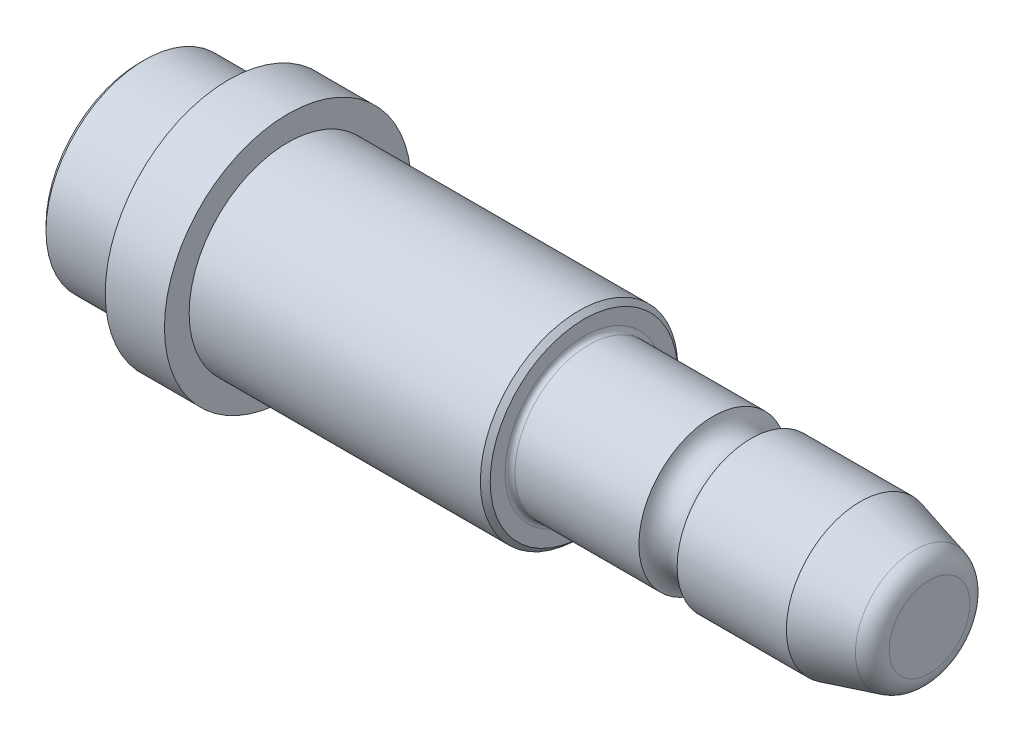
ISO-10303-21;
HEADER;
FILE_DESCRIPTION(('STEP AP214'),'2;1');
FILE_NAME('part.step','',(''),(''),'','','');
FILE_SCHEMA(('AUTOMOTIVE_DESIGN { 1 0 10303 214 1 1 1 1 }'));
ENDSEC;
DATA;
#1=APPLICATION_CONTEXT('core data for automotive mechanical design processes');
#2=APPLICATION_PROTOCOL_DEFINITION('international standard','automotive_design',2000,#1);
#3=PRODUCT_CONTEXT('',#1,'mechanical');
#4=PRODUCT('Part','Part','',(#3));
#5=PRODUCT_RELATED_PRODUCT_CATEGORY('part','',(#4));
#6=PRODUCT_DEFINITION_FORMATION('','',#4);
#7=PRODUCT_DEFINITION_CONTEXT('part definition',#1,'design');
#8=PRODUCT_DEFINITION('design','',#6,#7);
#9=PRODUCT_DEFINITION_SHAPE('','',#8);
#10=(LENGTH_UNIT() NAMED_UNIT(*) SI_UNIT(.MILLI.,.METRE.));
#11=(NAMED_UNIT(*) PLANE_ANGLE_UNIT() SI_UNIT($,.RADIAN.));
#12=(NAMED_UNIT(*) SI_UNIT($,.STERADIAN.) SOLID_ANGLE_UNIT());
#13=UNCERTAINTY_MEASURE_WITH_UNIT(LENGTH_MEASURE(1.E-05),#10,'distance_accuracy_value','');
#14=(GEOMETRIC_REPRESENTATION_CONTEXT(3) GLOBAL_UNCERTAINTY_ASSIGNED_CONTEXT((#13)) GLOBAL_UNIT_ASSIGNED_CONTEXT((#10,
#11,#12)) REPRESENTATION_CONTEXT('',''));
#15=CARTESIAN_POINT('',(0.,0.,0.));
#16=DIRECTION('',(0.,0.,1.));
#17=DIRECTION('',(1.,0.,0.));
#18=AXIS2_PLACEMENT_3D('',#15,#16,#17);
#19=CARTESIAN_POINT('',(9.,12.5,0.));
#20=DIRECTION('',(1.,0.,0.));
#21=DIRECTION('',(0.,0.,-1.));
#22=AXIS2_PLACEMENT_3D('',#19,#20,#21);
#23=PLANE('',#22);
#24=CARTESIAN_POINT('',(9.,0.,0.));
#25=DIRECTION('',(-1.,0.,0.));
#26=DIRECTION('',(0.,0.,1.));
#27=AXIS2_PLACEMENT_3D('',#24,#25,#26);
#28=CIRCLE('',#27,10.);
#29=CARTESIAN_POINT('',(9.,0.,10.));
#30=VERTEX_POINT('',#29);
#31=EDGE_CURVE('E61',#30,#30,#28,.T.);
#32=ORIENTED_EDGE('',*,*,#31,.F.);
#33=EDGE_LOOP('',(#32));
#34=FACE_BOUND('',#33,.T.);
#35=CARTESIAN_POINT('',(9.,0.,0.));
#36=DIRECTION('',(-1.,0.,0.));
#37=DIRECTION('',(0.,0.,1.));
#38=AXIS2_PLACEMENT_3D('',#35,#36,#37);
#39=CIRCLE('',#38,12.5);
#40=CARTESIAN_POINT('',(9.,0.,12.5));
#41=VERTEX_POINT('',#40);
#42=EDGE_CURVE('E79',#41,#41,#39,.T.);
#43=ORIENTED_EDGE('',*,*,#42,.T.);
#44=EDGE_LOOP('',(#43));
#45=FACE_BOUND('',#44,.T.);
#46=ADVANCED_FACE('F30',(#34,#45),#23,.F.);
#47=CARTESIAN_POINT('',(-12.992566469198,0.,0.));
#48=DIRECTION('',(-1.,0.,0.));
#49=DIRECTION('',(0.,0.,1.));
#50=AXIS2_PLACEMENT_3D('',#47,#48,#49);
#51=CYLINDRICAL_SURFACE('',#50,10.);
#52=CARTESIAN_POINT('',(0.500000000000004,0.,0.));
#53=DIRECTION('',(1.,0.,0.));
#54=DIRECTION('',(0.,0.,-1.));
#55=AXIS2_PLACEMENT_3D('',#52,#53,#54);
#56=CIRCLE('',#55,10.);
#57=CARTESIAN_POINT('',(0.500000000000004,0.,-10.));
#58=VERTEX_POINT('',#57);
#59=EDGE_CURVE('E49',#58,#58,#56,.T.);
#60=ORIENTED_EDGE('',*,*,#59,.T.);
#61=EDGE_LOOP('',(#60));
#62=FACE_BOUND('',#61,.T.);
#63=ORIENTED_EDGE('',*,*,#31,.T.);
#64=EDGE_LOOP('',(#63));
#65=FACE_BOUND('',#64,.T.);
#66=ADVANCED_FACE('F109',(#62,#65),#51,.T.);
#67=CARTESIAN_POINT('',(0.,10.,0.));
#68=DIRECTION('',(1.,0.,0.));
#69=DIRECTION('',(0.,0.,-1.));
#70=AXIS2_PLACEMENT_3D('',#67,#68,#69);
#71=PLANE('',#70);
#72=CARTESIAN_POINT('',(0.,0.,0.));
#73=DIRECTION('',(1.,0.,0.));
#74=DIRECTION('',(0.,0.,-1.));
#75=AXIS2_PLACEMENT_3D('',#72,#73,#74);
#76=CIRCLE('',#75,9.5);
#77=CARTESIAN_POINT('',(0.,0.,-9.5));
#78=VERTEX_POINT('',#77);
#79=EDGE_CURVE('E52',#78,#78,#76,.F.);
#80=ORIENTED_EDGE('',*,*,#79,.T.);
#81=EDGE_LOOP('',(#80));
#82=FACE_BOUND('',#81,.T.);
#83=ADVANCED_FACE('F114',(#82),#71,.F.);
#84=CARTESIAN_POINT('',(80.,5.62435565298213,0.));
#85=DIRECTION('',(-1.,0.,0.));
#86=DIRECTION('',(0.,0.,1.));
#87=AXIS2_PLACEMENT_3D('',#84,#85,#86);
#88=PLANE('',#87);
#89=CARTESIAN_POINT('',(80.,0.,0.));
#90=DIRECTION('',(-1.,0.,0.));
#91=DIRECTION('',(0.,0.,1.));
#92=AXIS2_PLACEMENT_3D('',#89,#90,#91);
#93=CIRCLE('',#92,4.08970167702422);
#94=CARTESIAN_POINT('',(80.,0.,4.08970167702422));
#95=VERTEX_POINT('',#94);
#96=EDGE_CURVE('E10',#95,#95,#93,.F.);
#97=ORIENTED_EDGE('',*,*,#96,.T.);
#98=EDGE_LOOP('',(#97));
#99=FACE_BOUND('',#98,.T.);
#100=ADVANCED_FACE('F121',(#99),#88,.F.);
#101=CARTESIAN_POINT('',(80.,0.,0.));
#102=DIRECTION('',(-1.,0.,0.));
#103=DIRECTION('',(0.,0.,1.));
#104=AXIS2_PLACEMENT_3D('',#101,#102,#103);
#105=CONICAL_SURFACE('',#104,5.62435565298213,0.26179938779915);
#106=CARTESIAN_POINT('',(78.517638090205,0.,0.));
#107=DIRECTION('',(1.,0.,0.));
#108=DIRECTION('',(0.,0.,-1.));
#109=AXIS2_PLACEMENT_3D('',#106,#107,#108);
#110=CIRCLE('',#109,6.02155332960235);
#111=CARTESIAN_POINT('',(78.517638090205,0.,-6.02155332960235));
#112=VERTEX_POINT('',#111);
#113=EDGE_CURVE('E36',#112,#112,#110,.F.);
#114=ORIENTED_EDGE('',*,*,#113,.T.);
#115=EDGE_LOOP('',(#114));
#116=FACE_BOUND('',#115,.T.);
#117=CARTESIAN_POINT('',(73.,0.,0.));
#118=DIRECTION('',(-1.,0.,0.));
#119=DIRECTION('',(0.,0.,1.));
#120=AXIS2_PLACEMENT_3D('',#117,#118,#119);
#121=CIRCLE('',#120,7.5);
#122=CARTESIAN_POINT('',(73.,0.,7.5));
#123=VERTEX_POINT('',#122);
#124=EDGE_CURVE('E64',#123,#123,#121,.T.);
#125=ORIENTED_EDGE('',*,*,#124,.F.);
#126=EDGE_LOOP('',(#125));
#127=FACE_BOUND('',#126,.T.);
#128=ADVANCED_FACE('F127',(#116,#127),#105,.T.);
#129=CARTESIAN_POINT('',(-12.992566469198,0.,0.));
#130=DIRECTION('',(-1.,0.,0.));
#131=DIRECTION('',(0.,0.,1.));
#132=AXIS2_PLACEMENT_3D('',#129,#130,#131);
#133=CYLINDRICAL_SURFACE('',#132,7.5);
#134=CARTESIAN_POINT('',(61.9364916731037,0.,0.));
#135=DIRECTION('',(-1.,0.,0.));
#136=DIRECTION('',(0.,0.,1.));
#137=AXIS2_PLACEMENT_3D('',#134,#135,#136);
#138=CIRCLE('',#137,7.5);
#139=CARTESIAN_POINT('',(61.9364916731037,0.,7.5));
#140=VERTEX_POINT('',#139);
#141=EDGE_CURVE('E67',#140,#140,#138,.T.);
#142=ORIENTED_EDGE('',*,*,#141,.F.);
#143=EDGE_LOOP('',(#142));
#144=FACE_BOUND('',#143,.T.);
#145=ORIENTED_EDGE('',*,*,#124,.T.);
#146=EDGE_LOOP('',(#145));
#147=FACE_BOUND('',#146,.T.);
#148=ADVANCED_FACE('F130',(#144,#147),#133,.T.);
#149=CARTESIAN_POINT('',(60.,0.,0.));
#150=DIRECTION('',(-1.,0.,0.));
#151=DIRECTION('',(0.,0.,1.));
#152=AXIS2_PLACEMENT_3D('',#149,#150,#151);
#153=TOROIDAL_SURFACE('',#152,8.,2.);
#154=CARTESIAN_POINT('',(58.0635083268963,0.,0.));
#155=DIRECTION('',(-1.,0.,0.));
#156=DIRECTION('',(0.,0.,1.));
#157=AXIS2_PLACEMENT_3D('',#154,#155,#156);
#158=CIRCLE('',#157,7.5);
#159=CARTESIAN_POINT('',(58.0635083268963,0.,7.5));
#160=VERTEX_POINT('',#159);
#161=EDGE_CURVE('E70',#160,#160,#158,.T.);
#162=ORIENTED_EDGE('',*,*,#161,.F.);
#163=EDGE_LOOP('',(#162));
#164=FACE_BOUND('',#163,.T.);
#165=ORIENTED_EDGE('',*,*,#141,.T.);
#166=EDGE_LOOP('',(#165));
#167=FACE_BOUND('',#166,.T.);
#168=ADVANCED_FACE('F133',(#164,#167),#153,.F.);
#169=CARTESIAN_POINT('',(-12.992566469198,0.,0.));
#170=DIRECTION('',(-1.,0.,0.));
#171=DIRECTION('',(0.,0.,1.));
#172=AXIS2_PLACEMENT_3D('',#169,#170,#171);
#173=CYLINDRICAL_SURFACE('',#172,7.5);
#174=CARTESIAN_POINT('',(45.5,0.,0.));
#175=DIRECTION('',(-1.,0.,0.));
#176=DIRECTION('',(0.,0.,1.));
#177=AXIS2_PLACEMENT_3D('',#174,#175,#176);
#178=CIRCLE('',#177,7.5);
#179=CARTESIAN_POINT('',(45.5,0.,7.5));
#180=VERTEX_POINT('',#179);
#181=EDGE_CURVE('E40',#180,#180,#178,.F.);
#182=ORIENTED_EDGE('',*,*,#181,.T.);
#183=EDGE_LOOP('',(#182));
#184=FACE_BOUND('',#183,.T.);
#185=ORIENTED_EDGE('',*,*,#161,.T.);
#186=EDGE_LOOP('',(#185));
#187=FACE_BOUND('',#186,.T.);
#188=ADVANCED_FACE('F105',(#184,#187),#173,.T.);
#189=CARTESIAN_POINT('',(45.,10.,0.));
#190=DIRECTION('',(-1.,0.,0.));
#191=DIRECTION('',(0.,0.,1.));
#192=AXIS2_PLACEMENT_3D('',#189,#190,#191);
#193=PLANE('',#192);
#194=CARTESIAN_POINT('',(45.,0.,0.));
#195=DIRECTION('',(-1.,0.,0.));
#196=DIRECTION('',(0.,0.,1.));
#197=AXIS2_PLACEMENT_3D('',#194,#195,#196);
#198=CIRCLE('',#197,8.);
#199=CARTESIAN_POINT('',(45.,0.,8.));
#200=VERTEX_POINT('',#199);
#201=EDGE_CURVE('E44',#200,#200,#198,.T.);
#202=ORIENTED_EDGE('',*,*,#201,.T.);
#203=EDGE_LOOP('',(#202));
#204=FACE_BOUND('',#203,.T.);
#205=CARTESIAN_POINT('',(45.,0.,0.));
#206=DIRECTION('',(-1.,0.,0.));
#207=DIRECTION('',(0.,0.,1.));
#208=AXIS2_PLACEMENT_3D('',#205,#206,#207);
#209=CIRCLE('',#208,9.49999999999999);
#210=CARTESIAN_POINT('',(45.,0.,9.49999999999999));
#211=VERTEX_POINT('',#210);
#212=EDGE_CURVE('E55',#211,#211,#209,.F.);
#213=ORIENTED_EDGE('',*,*,#212,.T.);
#214=EDGE_LOOP('',(#213));
#215=FACE_BOUND('',#214,.T.);
#216=ADVANCED_FACE('F99',(#204,#215),#193,.F.);
#217=CARTESIAN_POINT('',(-12.992566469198,0.,0.));
#218=DIRECTION('',(-1.,0.,0.));
#219=DIRECTION('',(0.,0.,1.));
#220=AXIS2_PLACEMENT_3D('',#217,#218,#219);
#221=CYLINDRICAL_SURFACE('',#220,10.);
#222=CARTESIAN_POINT('',(44.5,0.,0.));
#223=DIRECTION('',(-1.,0.,0.));
#224=DIRECTION('',(0.,0.,1.));
#225=AXIS2_PLACEMENT_3D('',#222,#223,#224);
#226=CIRCLE('',#225,10.);
#227=CARTESIAN_POINT('',(44.5,0.,10.));
#228=VERTEX_POINT('',#227);
#229=EDGE_CURVE('E58',#228,#228,#226,.T.);
#230=ORIENTED_EDGE('',*,*,#229,.T.);
#231=EDGE_LOOP('',(#230));
#232=FACE_BOUND('',#231,.T.);
#233=CARTESIAN_POINT('',(15.,0.,0.));
#234=DIRECTION('',(-1.,0.,0.));
#235=DIRECTION('',(0.,0.,1.));
#236=AXIS2_PLACEMENT_3D('',#233,#234,#235);
#237=CIRCLE('',#236,10.);
#238=CARTESIAN_POINT('',(15.,0.,10.));
#239=VERTEX_POINT('',#238);
#240=EDGE_CURVE('E73',#239,#239,#237,.T.);
#241=ORIENTED_EDGE('',*,*,#240,.F.);
#242=EDGE_LOOP('',(#241));
#243=FACE_BOUND('',#242,.T.);
#244=ADVANCED_FACE('F94',(#232,#243),#221,.T.);
#245=CARTESIAN_POINT('',(15.,12.5,0.));
#246=DIRECTION('',(-1.,0.,0.));
#247=DIRECTION('',(0.,0.,1.));
#248=AXIS2_PLACEMENT_3D('',#245,#246,#247);
#249=PLANE('',#248);
#250=CARTESIAN_POINT('',(15.,0.,0.));
#251=DIRECTION('',(-1.,0.,0.));
#252=DIRECTION('',(0.,0.,1.));
#253=AXIS2_PLACEMENT_3D('',#250,#251,#252);
#254=CIRCLE('',#253,12.5);
#255=CARTESIAN_POINT('',(15.,0.,12.5));
#256=VERTEX_POINT('',#255);
#257=EDGE_CURVE('E76',#256,#256,#254,.T.);
#258=ORIENTED_EDGE('',*,*,#257,.F.);
#259=EDGE_LOOP('',(#258));
#260=FACE_BOUND('',#259,.T.);
#261=ORIENTED_EDGE('',*,*,#240,.T.);
#262=EDGE_LOOP('',(#261));
#263=FACE_BOUND('',#262,.T.);
#264=ADVANCED_FACE('F88',(#260,#263),#249,.F.);
#265=CARTESIAN_POINT('',(-12.992566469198,0.,0.));
#266=DIRECTION('',(-1.,0.,0.));
#267=DIRECTION('',(0.,0.,1.));
#268=AXIS2_PLACEMENT_3D('',#265,#266,#267);
#269=CYLINDRICAL_SURFACE('',#268,12.5);
#270=ORIENTED_EDGE('',*,*,#42,.F.);
#271=EDGE_LOOP('',(#270));
#272=FACE_BOUND('',#271,.T.);
#273=ORIENTED_EDGE('',*,*,#257,.T.);
#274=EDGE_LOOP('',(#273));
#275=FACE_BOUND('',#274,.T.);
#276=ADVANCED_FACE('F84',(#272,#275),#269,.T.);
#277=CARTESIAN_POINT('',(44.5,0.,0.));
#278=DIRECTION('',(-1.,0.,0.));
#279=DIRECTION('',(0.,0.,1.));
#280=AXIS2_PLACEMENT_3D('',#277,#278,#279);
#281=CONICAL_SURFACE('',#280,10.,0.785398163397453);
#282=ORIENTED_EDGE('',*,*,#212,.F.);
#283=EDGE_LOOP('',(#282));
#284=FACE_BOUND('',#283,.T.);
#285=ORIENTED_EDGE('',*,*,#229,.F.);
#286=EDGE_LOOP('',(#285));
#287=FACE_BOUND('',#286,.T.);
#288=ADVANCED_FACE('F87',(#284,#287),#281,.T.);
#289=CARTESIAN_POINT('',(0.,0.,0.));
#290=DIRECTION('',(1.,0.,0.));
#291=DIRECTION('',(0.,0.,-1.));
#292=AXIS2_PLACEMENT_3D('',#289,#290,#291);
#293=CONICAL_SURFACE('',#292,9.5,0.785398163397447);
#294=ORIENTED_EDGE('',*,*,#59,.F.);
#295=EDGE_LOOP('',(#294));
#296=FACE_BOUND('',#295,.T.);
#297=ORIENTED_EDGE('',*,*,#79,.F.);
#298=EDGE_LOOP('',(#297));
#299=FACE_BOUND('',#298,.T.);
#300=ADVANCED_FACE('F155',(#296,#299),#293,.T.);
#301=CARTESIAN_POINT('',(45.5,0.,0.));
#302=DIRECTION('',(-1.,0.,0.));
#303=DIRECTION('',(0.,0.,1.));
#304=AXIS2_PLACEMENT_3D('',#301,#302,#303);
#305=TOROIDAL_SURFACE('',#304,8.,0.5);
#306=ORIENTED_EDGE('',*,*,#181,.F.);
#307=EDGE_LOOP('',(#306));
#308=FACE_BOUND('',#307,.T.);
#309=ORIENTED_EDGE('',*,*,#201,.F.);
#310=EDGE_LOOP('',(#309));
#311=FACE_BOUND('',#310,.T.);
#312=ADVANCED_FACE('F151',(#308,#311),#305,.F.);
#313=CARTESIAN_POINT('',(78.,0.,0.));
#314=DIRECTION('',(-1.,0.,0.));
#315=DIRECTION('',(0.,0.,1.));
#316=AXIS2_PLACEMENT_3D('',#313,#314,#315);
#317=TOROIDAL_SURFACE('',#316,4.08970167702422,2.);
#318=ORIENTED_EDGE('',*,*,#96,.F.);
#319=EDGE_LOOP('',(#318));
#320=FACE_BOUND('',#319,.T.);
#321=ORIENTED_EDGE('',*,*,#113,.F.);
#322=EDGE_LOOP('',(#321));
#323=FACE_BOUND('',#322,.T.);
#324=ADVANCED_FACE('F154',(#320,#323),#317,.T.);
#325=CLOSED_SHELL('',(#46,#66,#83,#100,#128,#148,#168,#188,#216,#244,#264,#276,#288,#300,#312,#324));
#326=MANIFOLD_SOLID_BREP('B2',#325);
#327=ADVANCED_BREP_SHAPE_REPRESENTATION('',(#18,#326),#14);
#328=SHAPE_DEFINITION_REPRESENTATION(#9,#327);
ENDSEC;
END-ISO-10303-21;
